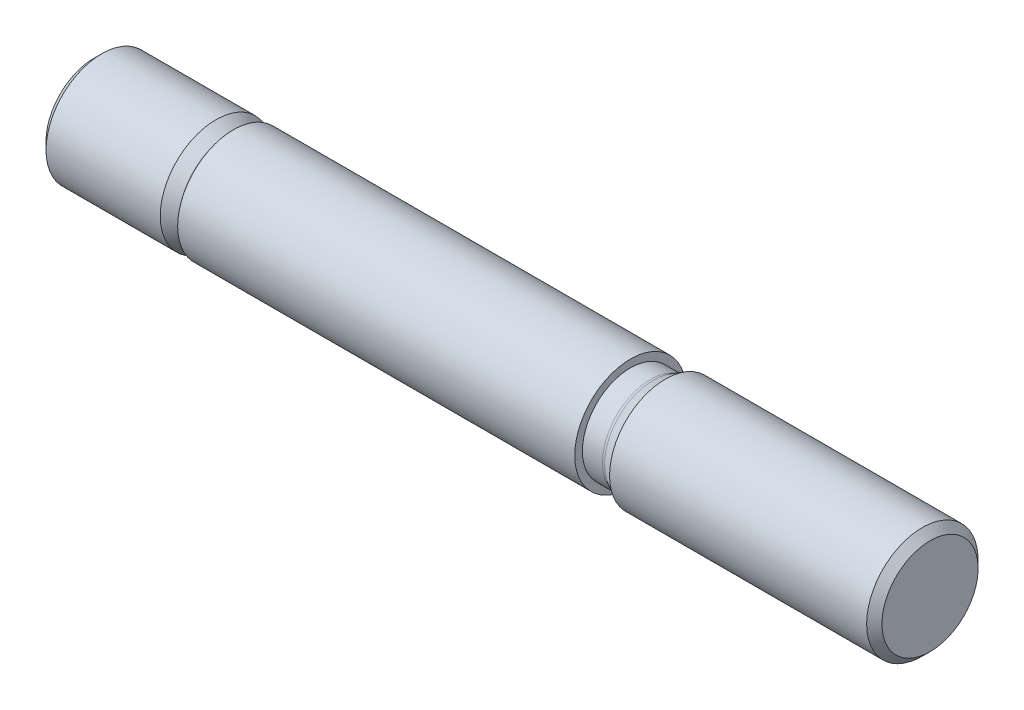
from build123d import *


with BuildPart() as part:
    # BodySke → BaseBody (revolve)
    with BuildSketch(Plane.XY, mode=Mode.PRIVATE) as basebody_sk:
        with BuildLine():
            Line((19.219615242, 7.007179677), (17.5, 8))
            Line((17.5, 8), (1.1, 8))
            Line((1.1, 8), (0, 6.9))
            Line((0, 6.9), (0, 0))
            Line((0, 0), (120, 0))
            Line((120, 0), (120, 6.9))
            Line((120, 6.9), (118.9, 8))
            Line((118.9, 8), (82, 8))
            Line((82, 8), (80.280384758, 7.007179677))
            ThreePointArc((80.280384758, 7.007179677), (80.087439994, 6.927259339), (79.880384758, 6.9))
            Line((79.880384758, 6.9), (77, 6.9))
            Line((77, 6.9), (77, 8))
            Line((77, 8), (20, 8))
            Line((20, 8), (20, 6.9))
            Line((20, 6.9), (19.619615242, 6.9))
            ThreePointArc((19.619615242, 6.9), (19.412560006, 6.927259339), (19.219615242, 7.007179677))
        make_face()
    revolve(basebody_sk.sketch.rotate(Axis((-3.175, 0, 0), (1, 0, 0)), 90), axis=Axis((-3.175, 0, 0), (1, 0, 0)))


solid = part.part
